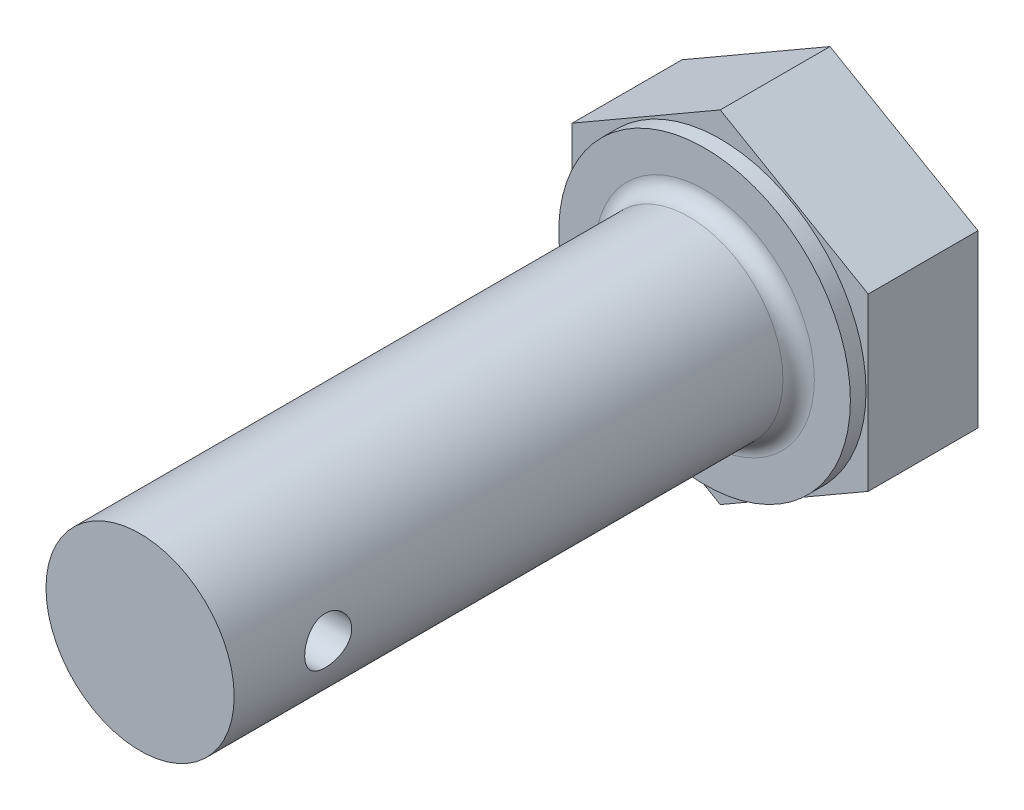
from build123d import *

# Parameters (mm, degrees)
LINEAR_AUSTRAGEN1_DEPTH          = 3.5
SKIZZE2_R                        = 4.65
LINEAR_AUSTRAGEN2_DEPTH          = 0.5
SKIZZE3_R                        = 3
LINEAR_AUSTRAGEN3_DEPTH          = 18
F_1_5_1_5_DURCHMESSER_BOHRUNG1_D = 1.5
VERRUNDUNG1_R                    = 0.5


with BuildPart() as part:
    # Skizze1 → Linear austragen1 (new body)
    with BuildSketch(Plane.XY):
        Polygon((-26.223410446, 5.45), (-30.943248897, 2.725), (-30.943248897, -2.725), (-26.223410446, -5.45), (-21.503571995, -2.725), (-21.503571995, 2.725), align=None)
    extrude(amount=LINEAR_AUSTRAGEN1_DEPTH)

    # Skizze2 → Linear austragen2 (add)
    with BuildSketch(Plane.XY.offset(3.5)):
        with Locations((-26.223410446, 0)):
            Circle(SKIZZE2_R)
    extrude(amount=LINEAR_AUSTRAGEN2_DEPTH)

    # Skizze3 → Linear austragen3 (add)
    with BuildSketch(Plane.XY.offset(4)):
        with Locations((-26.223410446, 0)):
            Circle(SKIZZE3_R)
    extrude(amount=LINEAR_AUSTRAGEN3_DEPTH)

    # 1.5 _1.5_ Durchmesser Bohrung1 (through all)
    with Locations(Plane(origin=(-21.503571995, 0, 0), x_dir=(0, 0, -1), z_dir=(1, 0, 0))):
        with Locations((-19, 0)):
            Hole(F_1_5_1_5_DURCHMESSER_BOHRUNG1_D / 2)

    # Verrundung1
    verrundung1_edges = [part.edges().sort_by_distance(p)[0] for p in [
        (-29.223410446, 0, 4),
    ]]
    fillet(verrundung1_edges, radius=VERRUNDUNG1_R)


solid = part.part
